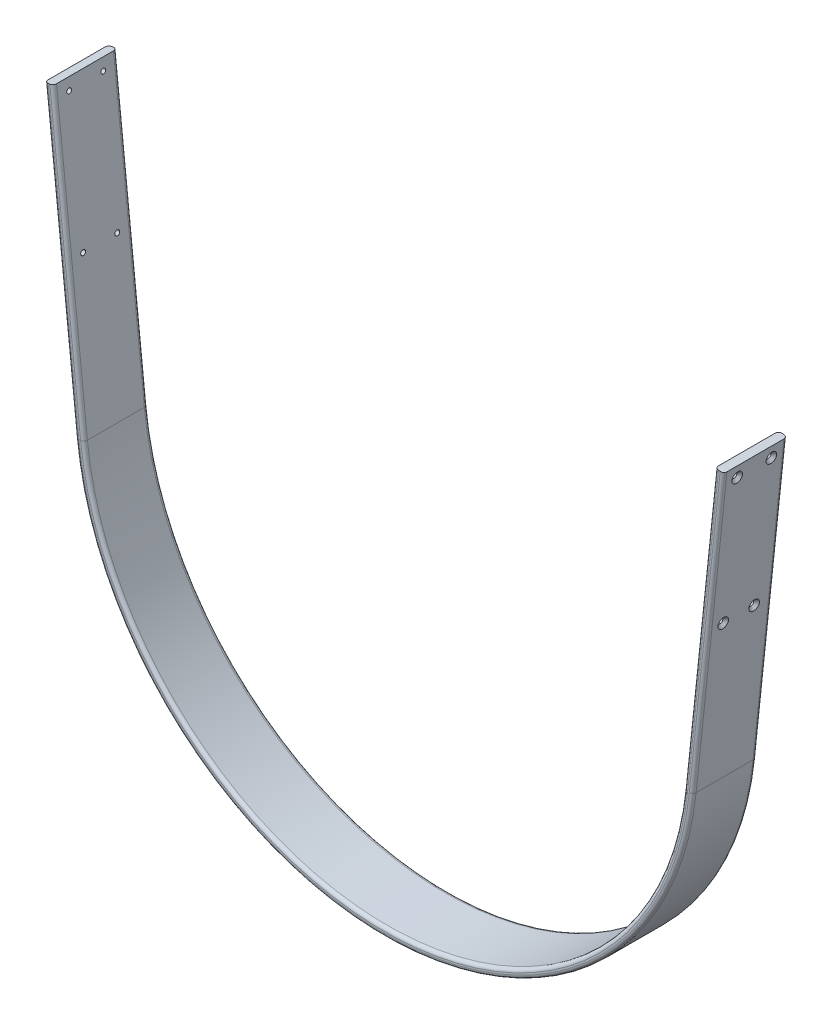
from build123d import *

# Parameters (mm, degrees)
EXTRUSION1_DEPTH        = 56
CONG_2_R                = 6
ESQUISSE2_R             = 4.25
ENL_V_MAT_EXTRU_1_DEPTH = 20
ESQUISSE3_R             = 4.25
ENL_V_MAT_EXTRU_2_DEPTH = 20
CHANFREIN1_SIZE         = 5


with BuildPart() as part:
    # Esquisse1 → Extrusion1 (new, symmetric)
    with BuildSketch(Plane.XY):
        with BuildLine():
            Line((542.014432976, -56.968012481), (596.160176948, 458.19432932))
            Line((596.160176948, 458.19432932), (581.242348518, 459.762256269))
            Line((581.242348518, 459.762256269), (527.096604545, -55.400085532))
            ThreePointArc((527.096604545, -55.400085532), (0, -530), (-527.096604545, -55.400085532))
            Line((-527.096604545, -55.400085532), (-581.242348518, 459.762256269))
            Line((-581.242348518, 459.762256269), (-596.160176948, 458.19432932))
            Line((-596.160176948, 458.19432932), (-542.014432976, -56.968012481))
            ThreePointArc((-542.014432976, -56.968012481), (0, -545), (542.014432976, -56.968012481))
        make_face()
    extrude(amount=EXTRUSION1_DEPTH, both=True)

    # Cong_2
    cong_2_edges = [part.edges().sort_by_distance(p)[0] for p in [
        (569.087304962, 200.61315842, -56),
        (569.087304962, 200.61315842, 56),
        (0, -545, -56),
        (0, -545, 56),
        (-569.087304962, 200.61315842, -56),
        (-569.087304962, 200.61315842, 56),
        (-554.169476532, 202.181085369, -56),
        (-554.169476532, 202.181085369, 56),
        (0, -530, -56),
        (0, -530, 56),
        (554.169476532, 202.181085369, -56),
        (554.169476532, 202.181085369, 56),
    ]]
    fillet(cong_2_edges, radius=CONG_2_R)

    # Esquisse2 → Enl_v. mat.-Extru.1 (cut)
    with BuildSketch(Plane(origin=(-542.014432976, -56.968012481, 0), x_dir=(0, 0, 1), z_dir=(-0.9945218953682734, -0.10452846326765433, 0))):
        with Locations(Location((30, 498, 0), (0, 0, 270))):
            Circle(ESQUISSE2_R)
        with Locations(Location((-30, 498, 0), (0, 0, 270))):
            Circle(ESQUISSE2_R)
        with Locations(Location((30, 263, 0), (0, 0, 270))):
            Circle(ESQUISSE2_R)
        with Locations(Location((-30, 263, 0), (0, 0, 270))):
            Circle(ESQUISSE2_R)
    extrude(amount=-ENL_V_MAT_EXTRU_1_DEPTH, mode=Mode.SUBTRACT)

    # Esquisse3 → Enl_v. mat.-Extru.2 (cut)
    with BuildSketch(Plane(origin=(542.014432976, -56.968012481, 0), x_dir=(0, 0, -1), z_dir=(0.9945218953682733, -0.10452846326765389, 0))):
        with Locations(Location((30, 498, 0), (0, 0, 90))):
            Circle(ESQUISSE3_R)
        with Locations(Location((-30, 498, 0), (0, 0, 90))):
            Circle(ESQUISSE3_R)
        with Locations(Location((-30, 263, 0), (0, 0, 90))):
            Circle(ESQUISSE3_R)
        with Locations(Location((24.42421264, 263, 0), (0, 0, 90))):
            Circle(ESQUISSE3_R)
    extrude(amount=-ENL_V_MAT_EXTRU_2_DEPTH, mode=Mode.SUBTRACT)

    # Chanfrein1
    chanfrein1_edges = [part.edges().sort_by_distance(p)[0] for p in [
        (569.061172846, 200.364527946, -24.42421264),
        (593.625361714, 434.077173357, -30),
        (569.061172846, 200.364527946, 30),
        (593.625361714, 434.077173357, 30),
        (-594.513853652, 442.530609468, -30),
        (-569.949664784, 208.817964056, -30),
        (-594.513853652, 442.530609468, 30),
        (-569.949664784, 208.817964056, 30),
    ]]
    chamfer(chanfrein1_edges, length=CHANFREIN1_SIZE)


solid = part.part
